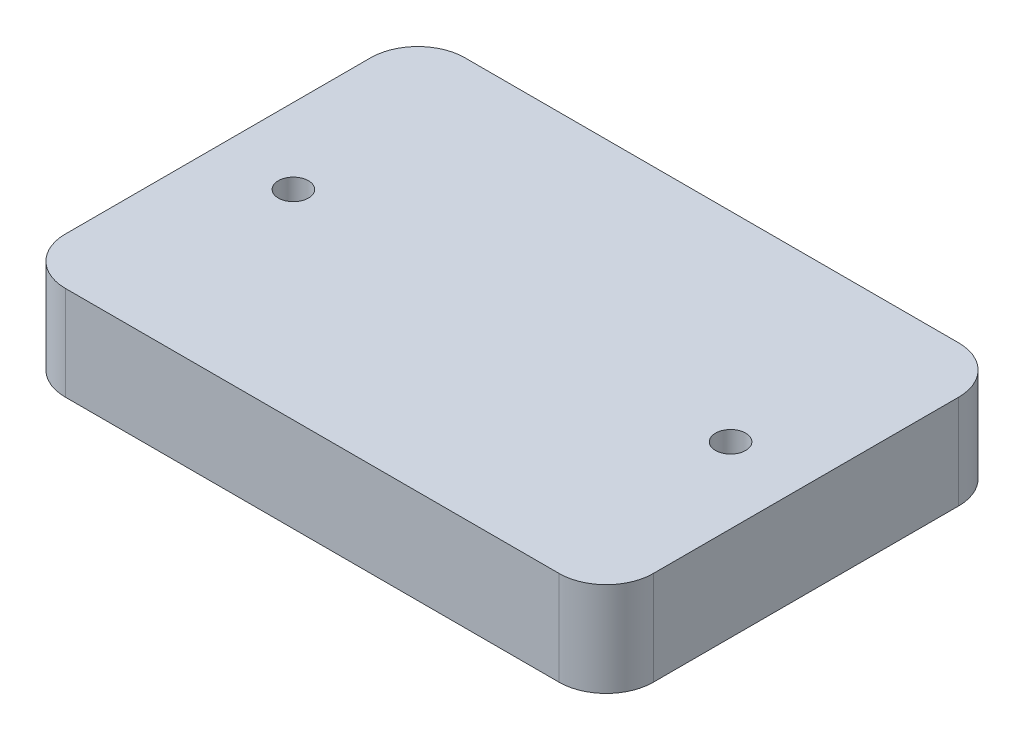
ISO-10303-21;
HEADER;
FILE_DESCRIPTION(('STEP AP214'),'2;1');
FILE_NAME('part.step','',(''),(''),'','','');
FILE_SCHEMA(('AUTOMOTIVE_DESIGN { 1 0 10303 214 1 1 1 1 }'));
ENDSEC;
DATA;
#1=APPLICATION_CONTEXT('core data for automotive mechanical design processes');
#2=APPLICATION_PROTOCOL_DEFINITION('international standard','automotive_design',2000,#1);
#3=PRODUCT_CONTEXT('',#1,'mechanical');
#4=PRODUCT('Part','Part','',(#3));
#5=PRODUCT_RELATED_PRODUCT_CATEGORY('part','',(#4));
#6=PRODUCT_DEFINITION_FORMATION('','',#4);
#7=PRODUCT_DEFINITION_CONTEXT('part definition',#1,'design');
#8=PRODUCT_DEFINITION('design','',#6,#7);
#9=PRODUCT_DEFINITION_SHAPE('','',#8);
#10=(LENGTH_UNIT() NAMED_UNIT(*) SI_UNIT(.MILLI.,.METRE.));
#11=(NAMED_UNIT(*) PLANE_ANGLE_UNIT() SI_UNIT($,.RADIAN.));
#12=(NAMED_UNIT(*) SI_UNIT($,.STERADIAN.) SOLID_ANGLE_UNIT());
#13=UNCERTAINTY_MEASURE_WITH_UNIT(LENGTH_MEASURE(1.E-05),#10,'distance_accuracy_value','');
#14=(GEOMETRIC_REPRESENTATION_CONTEXT(3) GLOBAL_UNCERTAINTY_ASSIGNED_CONTEXT((#13)) GLOBAL_UNIT_ASSIGNED_CONTEXT((#10,
#11,#12)) REPRESENTATION_CONTEXT('',''));
#15=CARTESIAN_POINT('',(0.,0.,0.));
#16=DIRECTION('',(0.,0.,1.));
#17=DIRECTION('',(1.,0.,0.));
#18=AXIS2_PLACEMENT_3D('',#15,#16,#17);
#19=CARTESIAN_POINT('',(52.4,10.,-32.4));
#20=DIRECTION('',(0.,-1.,0.));
#21=DIRECTION('',(0.,0.,-1.));
#22=AXIS2_PLACEMENT_3D('',#19,#20,#21);
#23=PLANE('',#22);
#24=CARTESIAN_POINT('',(3.00000000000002,10.,-16.2));
#25=DIRECTION('',(0.,1.,0.));
#26=DIRECTION('',(0.,0.,1.));
#27=AXIS2_PLACEMENT_3D('',#24,#25,#26);
#28=CIRCLE('',#27,1.6);
#29=CARTESIAN_POINT('',(3.00000000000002,10.,-14.6));
#30=VERTEX_POINT('',#29);
#31=EDGE_CURVE('E118',#30,#30,#28,.T.);
#32=ORIENTED_EDGE('',*,*,#31,.F.);
#33=EDGE_LOOP('',(#32));
#34=FACE_BOUND('',#33,.T.);
#35=CARTESIAN_POINT('',(52.4,10.,-32.4));
#36=DIRECTION('',(0.,1.,0.));
#37=DIRECTION('',(0.,0.,-1.));
#38=AXIS2_PLACEMENT_3D('',#35,#36,#37);
#39=CIRCLE('',#38,5.);
#40=CARTESIAN_POINT('',(57.4,10.,-32.4));
#41=VERTEX_POINT('',#40);
#42=CARTESIAN_POINT('',(52.4,10.,-37.4));
#43=VERTEX_POINT('',#42);
#44=EDGE_CURVE('E129',#41,#43,#39,.T.);
#45=ORIENTED_EDGE('',*,*,#44,.T.);
#46=DIRECTION('',(-1.,0.,0.));
#47=VECTOR('',#46,1.);
#48=CARTESIAN_POINT('',(0.,10.,-37.4));
#49=LINE('',#48,#47);
#50=CARTESIAN_POINT('',(0.,10.,-37.4));
#51=VERTEX_POINT('',#50);
#52=EDGE_CURVE('E77',#43,#51,#49,.T.);
#53=ORIENTED_EDGE('',*,*,#52,.T.);
#54=CARTESIAN_POINT('',(0.,10.,-32.4));
#55=DIRECTION('',(0.,1.,0.));
#56=DIRECTION('',(0.,0.,1.));
#57=AXIS2_PLACEMENT_3D('',#54,#55,#56);
#58=CIRCLE('',#57,5.);
#59=CARTESIAN_POINT('',(-5.,10.,-32.4));
#60=VERTEX_POINT('',#59);
#61=EDGE_CURVE('E144',#51,#60,#58,.T.);
#62=ORIENTED_EDGE('',*,*,#61,.T.);
#63=DIRECTION('',(0.,0.,1.));
#64=VECTOR('',#63,1.);
#65=CARTESIAN_POINT('',(-5.,10.,-32.4));
#66=LINE('',#65,#64);
#67=CARTESIAN_POINT('',(-5.,10.,0.));
#68=VERTEX_POINT('',#67);
#69=EDGE_CURVE('E157',#60,#68,#66,.T.);
#70=ORIENTED_EDGE('',*,*,#69,.T.);
#71=CARTESIAN_POINT('',(0.,10.,0.));
#72=DIRECTION('',(0.,1.,0.));
#73=DIRECTION('',(0.,0.,1.));
#74=AXIS2_PLACEMENT_3D('',#71,#72,#73);
#75=CIRCLE('',#74,5.);
#76=CARTESIAN_POINT('',(0.,10.,5.));
#77=VERTEX_POINT('',#76);
#78=EDGE_CURVE('E96',#68,#77,#75,.T.);
#79=ORIENTED_EDGE('',*,*,#78,.T.);
#80=DIRECTION('',(1.,0.,0.));
#81=VECTOR('',#80,1.);
#82=CARTESIAN_POINT('',(0.,10.,5.));
#83=LINE('',#82,#81);
#84=CARTESIAN_POINT('',(52.4,10.,5.));
#85=VERTEX_POINT('',#84);
#86=EDGE_CURVE('E90',#77,#85,#83,.T.);
#87=ORIENTED_EDGE('',*,*,#86,.T.);
#88=CARTESIAN_POINT('',(52.4,10.,0.));
#89=DIRECTION('',(0.,1.,0.));
#90=DIRECTION('',(0.,0.,1.));
#91=AXIS2_PLACEMENT_3D('',#88,#89,#90);
#92=CIRCLE('',#91,5.);
#93=CARTESIAN_POINT('',(57.4,10.,0.));
#94=VERTEX_POINT('',#93);
#95=EDGE_CURVE('E94',#85,#94,#92,.T.);
#96=ORIENTED_EDGE('',*,*,#95,.T.);
#97=DIRECTION('',(0.,0.,-1.));
#98=VECTOR('',#97,1.);
#99=CARTESIAN_POINT('',(57.4,10.,-32.4));
#100=LINE('',#99,#98);
#101=EDGE_CURVE('E34',#94,#41,#100,.T.);
#102=ORIENTED_EDGE('',*,*,#101,.T.);
#103=EDGE_LOOP('',(#45,#53,#62,#70,#79,#87,#96,#102));
#104=FACE_BOUND('',#103,.T.);
#105=CARTESIAN_POINT('',(49.4,10.,-16.2));
#106=DIRECTION('',(0.,1.,0.));
#107=DIRECTION('',(0.,0.,-1.));
#108=AXIS2_PLACEMENT_3D('',#105,#106,#107);
#109=CIRCLE('',#108,1.6);
#110=CARTESIAN_POINT('',(49.4,10.,-17.8));
#111=VERTEX_POINT('',#110);
#112=EDGE_CURVE('E166',#111,#111,#109,.T.);
#113=ORIENTED_EDGE('',*,*,#112,.F.);
#114=EDGE_LOOP('',(#113));
#115=FACE_BOUND('',#114,.T.);
#116=ADVANCED_FACE('F17',(#34,#104,#115),#23,.F.);
#117=CARTESIAN_POINT('',(52.4,0.,-32.4));
#118=DIRECTION('',(0.,-1.,0.));
#119=DIRECTION('',(0.,0.,-1.));
#120=AXIS2_PLACEMENT_3D('',#117,#118,#119);
#121=PLANE('',#120);
#122=CARTESIAN_POINT('',(3.00000000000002,0.,-16.2));
#123=DIRECTION('',(0.,1.,0.));
#124=DIRECTION('',(0.,0.,1.));
#125=AXIS2_PLACEMENT_3D('',#122,#123,#124);
#126=CIRCLE('',#125,1.6);
#127=CARTESIAN_POINT('',(3.00000000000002,0.,-14.6));
#128=VERTEX_POINT('',#127);
#129=EDGE_CURVE('E163',#128,#128,#126,.T.);
#130=ORIENTED_EDGE('',*,*,#129,.T.);
#131=EDGE_LOOP('',(#130));
#132=FACE_BOUND('',#131,.T.);
#133=CARTESIAN_POINT('',(52.4,0.,-32.4));
#134=DIRECTION('',(0.,1.,0.));
#135=DIRECTION('',(0.,0.,-1.));
#136=AXIS2_PLACEMENT_3D('',#133,#134,#135);
#137=CIRCLE('',#136,5.);
#138=CARTESIAN_POINT('',(57.4,0.,-32.4));
#139=VERTEX_POINT('',#138);
#140=CARTESIAN_POINT('',(52.4,0.,-37.4));
#141=VERTEX_POINT('',#140);
#142=EDGE_CURVE('E114',#139,#141,#137,.T.);
#143=ORIENTED_EDGE('',*,*,#142,.F.);
#144=DIRECTION('',(0.,0.,-1.));
#145=VECTOR('',#144,1.);
#146=CARTESIAN_POINT('',(57.4,0.,-32.4));
#147=LINE('',#146,#145);
#148=CARTESIAN_POINT('',(57.4,0.,0.));
#149=VERTEX_POINT('',#148);
#150=EDGE_CURVE('E69',#149,#139,#147,.T.);
#151=ORIENTED_EDGE('',*,*,#150,.F.);
#152=CARTESIAN_POINT('',(52.4,0.,0.));
#153=DIRECTION('',(0.,1.,0.));
#154=DIRECTION('',(0.,0.,1.));
#155=AXIS2_PLACEMENT_3D('',#152,#153,#154);
#156=CIRCLE('',#155,5.);
#157=CARTESIAN_POINT('',(52.4,0.,5.));
#158=VERTEX_POINT('',#157);
#159=EDGE_CURVE('E63',#158,#149,#156,.T.);
#160=ORIENTED_EDGE('',*,*,#159,.F.);
#161=DIRECTION('',(1.,0.,0.));
#162=VECTOR('',#161,1.);
#163=CARTESIAN_POINT('',(0.,0.,5.));
#164=LINE('',#163,#162);
#165=CARTESIAN_POINT('',(0.,0.,5.));
#166=VERTEX_POINT('',#165);
#167=EDGE_CURVE('E104',#166,#158,#164,.T.);
#168=ORIENTED_EDGE('',*,*,#167,.F.);
#169=CARTESIAN_POINT('',(0.,0.,0.));
#170=DIRECTION('',(0.,1.,0.));
#171=DIRECTION('',(0.,0.,1.));
#172=AXIS2_PLACEMENT_3D('',#169,#170,#171);
#173=CIRCLE('',#172,5.);
#174=CARTESIAN_POINT('',(-5.,0.,0.));
#175=VERTEX_POINT('',#174);
#176=EDGE_CURVE('E124',#175,#166,#173,.T.);
#177=ORIENTED_EDGE('',*,*,#176,.F.);
#178=DIRECTION('',(0.,0.,1.));
#179=VECTOR('',#178,1.);
#180=CARTESIAN_POINT('',(-5.,0.,-32.4));
#181=LINE('',#180,#179);
#182=CARTESIAN_POINT('',(-5.,0.,-32.4));
#183=VERTEX_POINT('',#182);
#184=EDGE_CURVE('E122',#183,#175,#181,.T.);
#185=ORIENTED_EDGE('',*,*,#184,.F.);
#186=CARTESIAN_POINT('',(0.,0.,-32.4));
#187=DIRECTION('',(0.,1.,0.));
#188=DIRECTION('',(0.,0.,1.));
#189=AXIS2_PLACEMENT_3D('',#186,#187,#188);
#190=CIRCLE('',#189,5.);
#191=CARTESIAN_POINT('',(0.,0.,-37.4));
#192=VERTEX_POINT('',#191);
#193=EDGE_CURVE('E120',#192,#183,#190,.T.);
#194=ORIENTED_EDGE('',*,*,#193,.F.);
#195=DIRECTION('',(-1.,0.,0.));
#196=VECTOR('',#195,1.);
#197=CARTESIAN_POINT('',(0.,0.,-37.4));
#198=LINE('',#197,#196);
#199=EDGE_CURVE('E117',#141,#192,#198,.T.);
#200=ORIENTED_EDGE('',*,*,#199,.F.);
#201=EDGE_LOOP('',(#143,#151,#160,#168,#177,#185,#194,#200));
#202=FACE_BOUND('',#201,.T.);
#203=CARTESIAN_POINT('',(49.4,0.,-16.2));
#204=DIRECTION('',(0.,1.,0.));
#205=DIRECTION('',(0.,0.,-1.));
#206=AXIS2_PLACEMENT_3D('',#203,#204,#205);
#207=CIRCLE('',#206,1.6);
#208=CARTESIAN_POINT('',(49.4,0.,-17.8));
#209=VERTEX_POINT('',#208);
#210=EDGE_CURVE('E169',#209,#209,#207,.T.);
#211=ORIENTED_EDGE('',*,*,#210,.T.);
#212=EDGE_LOOP('',(#211));
#213=FACE_BOUND('',#212,.T.);
#214=ADVANCED_FACE('F148',(#132,#202,#213),#121,.T.);
#215=CARTESIAN_POINT('',(52.4,10.,-32.4));
#216=DIRECTION('',(0.,-1.,0.));
#217=DIRECTION('',(0.,0.,-1.));
#218=AXIS2_PLACEMENT_3D('',#215,#216,#217);
#219=CYLINDRICAL_SURFACE('',#218,5.);
#220=ORIENTED_EDGE('',*,*,#142,.T.);
#221=DIRECTION('',(0.,-1.,0.));
#222=VECTOR('',#221,1.);
#223=CARTESIAN_POINT('',(52.4,10.,-37.4));
#224=LINE('',#223,#222);
#225=EDGE_CURVE('E11',#43,#141,#224,.T.);
#226=ORIENTED_EDGE('',*,*,#225,.F.);
#227=ORIENTED_EDGE('',*,*,#44,.F.);
#228=DIRECTION('',(0.,-1.,0.));
#229=VECTOR('',#228,1.);
#230=CARTESIAN_POINT('',(57.4,10.,-32.4));
#231=LINE('',#230,#229);
#232=EDGE_CURVE('E110',#41,#139,#231,.T.);
#233=ORIENTED_EDGE('',*,*,#232,.T.);
#234=EDGE_LOOP('',(#220,#226,#227,#233));
#235=FACE_BOUND('',#234,.T.);
#236=ADVANCED_FACE('F19',(#235),#219,.T.);
#237=CARTESIAN_POINT('',(0.,10.,-37.4));
#238=DIRECTION('',(0.,0.,1.));
#239=DIRECTION('',(1.,0.,0.));
#240=AXIS2_PLACEMENT_3D('',#237,#238,#239);
#241=PLANE('',#240);
#242=ORIENTED_EDGE('',*,*,#199,.T.);
#243=DIRECTION('',(0.,-1.,0.));
#244=VECTOR('',#243,1.);
#245=CARTESIAN_POINT('',(0.,10.,-37.4));
#246=LINE('',#245,#244);
#247=EDGE_CURVE('E26',#51,#192,#246,.T.);
#248=ORIENTED_EDGE('',*,*,#247,.F.);
#249=ORIENTED_EDGE('',*,*,#52,.F.);
#250=ORIENTED_EDGE('',*,*,#225,.T.);
#251=EDGE_LOOP('',(#242,#248,#249,#250));
#252=FACE_BOUND('',#251,.T.);
#253=ADVANCED_FACE('F204',(#252),#241,.F.);
#254=CARTESIAN_POINT('',(0.,10.,-32.4));
#255=DIRECTION('',(0.,-1.,0.));
#256=DIRECTION('',(0.,0.,-1.));
#257=AXIS2_PLACEMENT_3D('',#254,#255,#256);
#258=CYLINDRICAL_SURFACE('',#257,5.);
#259=ORIENTED_EDGE('',*,*,#193,.T.);
#260=DIRECTION('',(0.,-1.,0.));
#261=VECTOR('',#260,1.);
#262=CARTESIAN_POINT('',(-5.,10.,-32.4));
#263=LINE('',#262,#261);
#264=EDGE_CURVE('E136',#60,#183,#263,.T.);
#265=ORIENTED_EDGE('',*,*,#264,.F.);
#266=ORIENTED_EDGE('',*,*,#61,.F.);
#267=ORIENTED_EDGE('',*,*,#247,.T.);
#268=EDGE_LOOP('',(#259,#265,#266,#267));
#269=FACE_BOUND('',#268,.T.);
#270=ADVANCED_FACE('F142',(#269),#258,.T.);
#271=CARTESIAN_POINT('',(-5.,10.,-32.4));
#272=DIRECTION('',(1.,0.,0.));
#273=DIRECTION('',(0.,0.,-1.));
#274=AXIS2_PLACEMENT_3D('',#271,#272,#273);
#275=PLANE('',#274);
#276=ORIENTED_EDGE('',*,*,#184,.T.);
#277=DIRECTION('',(0.,-1.,0.));
#278=VECTOR('',#277,1.);
#279=CARTESIAN_POINT('',(-5.,10.,0.));
#280=LINE('',#279,#278);
#281=EDGE_CURVE('E133',#68,#175,#280,.T.);
#282=ORIENTED_EDGE('',*,*,#281,.F.);
#283=ORIENTED_EDGE('',*,*,#69,.F.);
#284=ORIENTED_EDGE('',*,*,#264,.T.);
#285=EDGE_LOOP('',(#276,#282,#283,#284));
#286=FACE_BOUND('',#285,.T.);
#287=ADVANCED_FACE('F153',(#286),#275,.F.);
#288=CARTESIAN_POINT('',(0.,10.,0.));
#289=DIRECTION('',(0.,-1.,0.));
#290=DIRECTION('',(0.,0.,-1.));
#291=AXIS2_PLACEMENT_3D('',#288,#289,#290);
#292=CYLINDRICAL_SURFACE('',#291,5.);
#293=ORIENTED_EDGE('',*,*,#176,.T.);
#294=DIRECTION('',(0.,-1.,0.));
#295=VECTOR('',#294,1.);
#296=CARTESIAN_POINT('',(0.,10.,5.));
#297=LINE('',#296,#295);
#298=EDGE_CURVE('E105',#77,#166,#297,.T.);
#299=ORIENTED_EDGE('',*,*,#298,.F.);
#300=ORIENTED_EDGE('',*,*,#78,.F.);
#301=ORIENTED_EDGE('',*,*,#281,.T.);
#302=EDGE_LOOP('',(#293,#299,#300,#301));
#303=FACE_BOUND('',#302,.T.);
#304=ADVANCED_FACE('F156',(#303),#292,.T.);
#305=CARTESIAN_POINT('',(0.,10.,5.));
#306=DIRECTION('',(0.,0.,-1.));
#307=DIRECTION('',(-1.,0.,0.));
#308=AXIS2_PLACEMENT_3D('',#305,#306,#307);
#309=PLANE('',#308);
#310=ORIENTED_EDGE('',*,*,#167,.T.);
#311=DIRECTION('',(0.,-1.,0.));
#312=VECTOR('',#311,1.);
#313=CARTESIAN_POINT('',(52.4,10.,5.));
#314=LINE('',#313,#312);
#315=EDGE_CURVE('E101',#85,#158,#314,.T.);
#316=ORIENTED_EDGE('',*,*,#315,.F.);
#317=ORIENTED_EDGE('',*,*,#86,.F.);
#318=ORIENTED_EDGE('',*,*,#298,.T.);
#319=EDGE_LOOP('',(#310,#316,#317,#318));
#320=FACE_BOUND('',#319,.T.);
#321=ADVANCED_FACE('F102',(#320),#309,.F.);
#322=CARTESIAN_POINT('',(52.4,10.,0.));
#323=DIRECTION('',(0.,-1.,0.));
#324=DIRECTION('',(0.,0.,-1.));
#325=AXIS2_PLACEMENT_3D('',#322,#323,#324);
#326=CYLINDRICAL_SURFACE('',#325,5.);
#327=ORIENTED_EDGE('',*,*,#159,.T.);
#328=DIRECTION('',(0.,-1.,0.));
#329=VECTOR('',#328,1.);
#330=CARTESIAN_POINT('',(57.4,10.,0.));
#331=LINE('',#330,#329);
#332=EDGE_CURVE('E106',#94,#149,#331,.T.);
#333=ORIENTED_EDGE('',*,*,#332,.F.);
#334=ORIENTED_EDGE('',*,*,#95,.F.);
#335=ORIENTED_EDGE('',*,*,#315,.T.);
#336=EDGE_LOOP('',(#327,#333,#334,#335));
#337=FACE_BOUND('',#336,.T.);
#338=ADVANCED_FACE('F108',(#337),#326,.T.);
#339=CARTESIAN_POINT('',(57.4,10.,-32.4));
#340=DIRECTION('',(-1.,0.,0.));
#341=DIRECTION('',(0.,0.,1.));
#342=AXIS2_PLACEMENT_3D('',#339,#340,#341);
#343=PLANE('',#342);
#344=ORIENTED_EDGE('',*,*,#150,.T.);
#345=ORIENTED_EDGE('',*,*,#232,.F.);
#346=ORIENTED_EDGE('',*,*,#101,.F.);
#347=ORIENTED_EDGE('',*,*,#332,.T.);
#348=EDGE_LOOP('',(#344,#345,#346,#347));
#349=FACE_BOUND('',#348,.T.);
#350=ADVANCED_FACE('F192',(#349),#343,.F.);
#351=CARTESIAN_POINT('',(3.00000000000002,10.,-16.2));
#352=DIRECTION('',(0.,-1.,0.));
#353=DIRECTION('',(0.,0.,-1.));
#354=AXIS2_PLACEMENT_3D('',#351,#352,#353);
#355=CYLINDRICAL_SURFACE('',#354,1.6);
#356=ORIENTED_EDGE('',*,*,#31,.T.);
#357=EDGE_LOOP('',(#356));
#358=FACE_BOUND('',#357,.T.);
#359=ORIENTED_EDGE('',*,*,#129,.F.);
#360=EDGE_LOOP('',(#359));
#361=FACE_BOUND('',#360,.T.);
#362=ADVANCED_FACE('F189',(#358,#361),#355,.F.);
#363=CARTESIAN_POINT('',(49.4,10.,-16.2));
#364=DIRECTION('',(0.,-1.,0.));
#365=DIRECTION('',(0.,0.,-1.));
#366=AXIS2_PLACEMENT_3D('',#363,#364,#365);
#367=CYLINDRICAL_SURFACE('',#366,1.6);
#368=ORIENTED_EDGE('',*,*,#112,.T.);
#369=EDGE_LOOP('',(#368));
#370=FACE_BOUND('',#369,.T.);
#371=ORIENTED_EDGE('',*,*,#210,.F.);
#372=EDGE_LOOP('',(#371));
#373=FACE_BOUND('',#372,.T.);
#374=ADVANCED_FACE('F175',(#370,#373),#367,.F.);
#375=CLOSED_SHELL('',(#116,#214,#236,#253,#270,#287,#304,#321,#338,#350,#362,#374));
#376=MANIFOLD_SOLID_BREP('B1',#375);
#377=ADVANCED_BREP_SHAPE_REPRESENTATION('',(#18,#376),#14);
#378=SHAPE_DEFINITION_REPRESENTATION(#9,#377);
ENDSEC;
END-ISO-10303-21;
